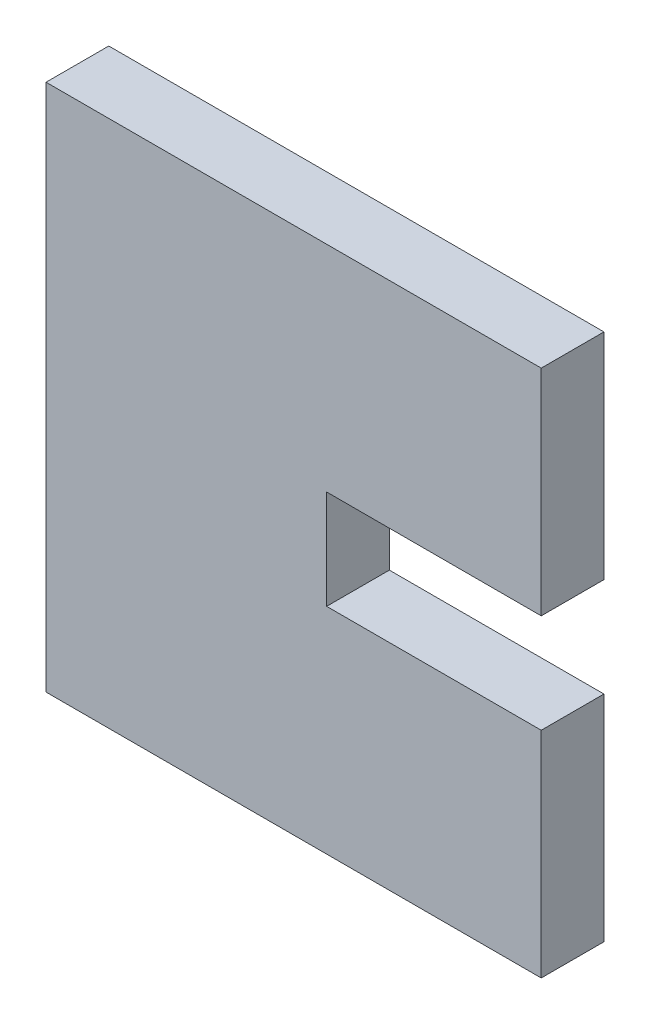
from build123d import *

# Parameters (mm, degrees)
AUFSATZ_LINEAR_AUSTRAGEN1_DEPTH = 4
FASE1_SIZE                      = 0.2


with BuildPart() as part:
    # Skizze2 → Aufsatz-Linear austragen1 (new body)
    with BuildSketch(Plane.XY):
        Polygon((-32, -16), (-32, 16), (-2, 16), (-2, 3), (-15, 3), (-15, -3), (-2, -3), (-2, -16), align=None)
    extrude(amount=AUFSATZ_LINEAR_AUSTRAGEN1_DEPTH)

    # Fase1
    fase1_edges = [part.edges().sort_by_distance(p)[0] for p in [
        (-15, 0, 0),
        (-8.5, 3, 0),
        (-2, 9.5, 0),
        (-17, 16, 0),
        (-32, 0, 0),
        (-17, -16, 0),
        (-2, -9.5, 0),
        (-8.5, -3, 0),
    ]]
    chamfer(fase1_edges, length=FASE1_SIZE)


solid = part.part
